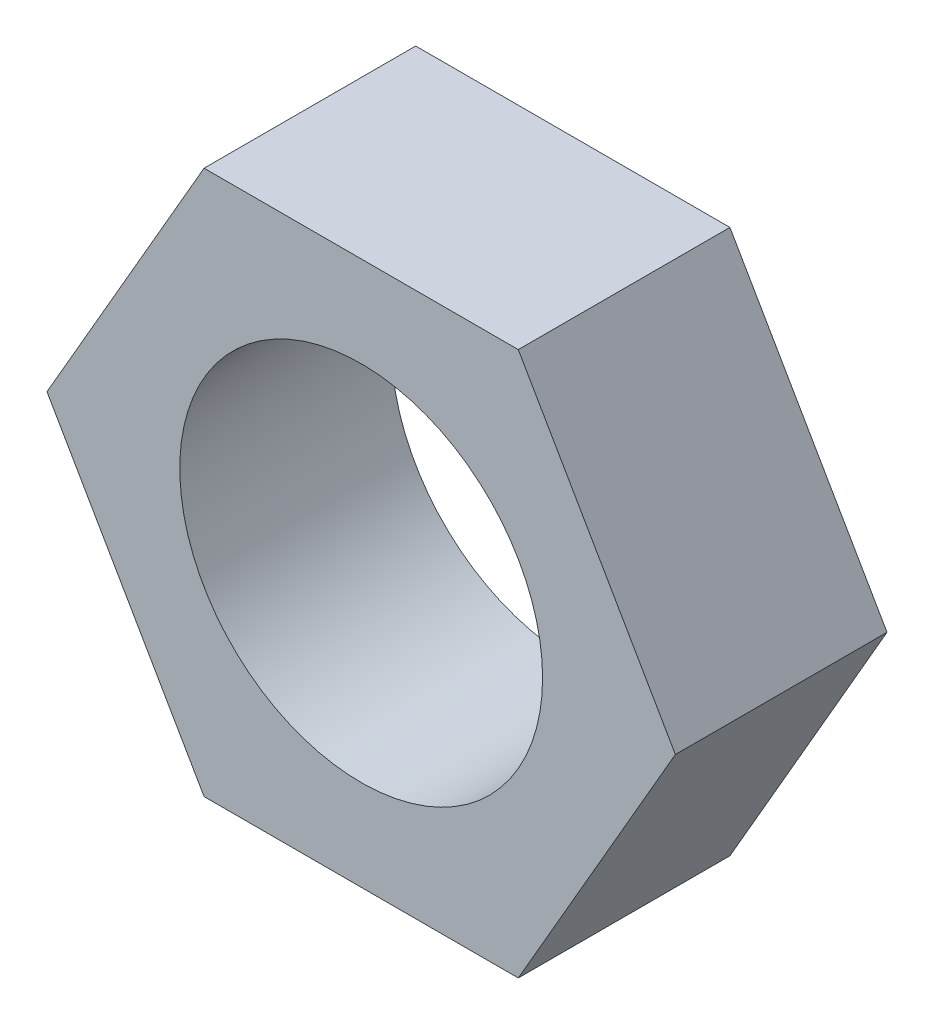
ISO-10303-21;
HEADER;
FILE_DESCRIPTION(('STEP AP214'),'2;1');
FILE_NAME('part.step','',(''),(''),'','','');
FILE_SCHEMA(('AUTOMOTIVE_DESIGN { 1 0 10303 214 1 1 1 1 }'));
ENDSEC;
DATA;
#1=APPLICATION_CONTEXT('core data for automotive mechanical design processes');
#2=APPLICATION_PROTOCOL_DEFINITION('international standard','automotive_design',2000,#1);
#3=PRODUCT_CONTEXT('',#1,'mechanical');
#4=PRODUCT('Part','Part','',(#3));
#5=PRODUCT_RELATED_PRODUCT_CATEGORY('part','',(#4));
#6=PRODUCT_DEFINITION_FORMATION('','',#4);
#7=PRODUCT_DEFINITION_CONTEXT('part definition',#1,'design');
#8=PRODUCT_DEFINITION('design','',#6,#7);
#9=PRODUCT_DEFINITION_SHAPE('','',#8);
#10=(LENGTH_UNIT() NAMED_UNIT(*) SI_UNIT(.MILLI.,.METRE.));
#11=(NAMED_UNIT(*) PLANE_ANGLE_UNIT() SI_UNIT($,.RADIAN.));
#12=(NAMED_UNIT(*) SI_UNIT($,.STERADIAN.) SOLID_ANGLE_UNIT());
#13=UNCERTAINTY_MEASURE_WITH_UNIT(LENGTH_MEASURE(1.E-05),#10,'distance_accuracy_value','');
#14=(GEOMETRIC_REPRESENTATION_CONTEXT(3) GLOBAL_UNCERTAINTY_ASSIGNED_CONTEXT((#13)) GLOBAL_UNIT_ASSIGNED_CONTEXT((#10,
#11,#12)) REPRESENTATION_CONTEXT('',''));
#15=CARTESIAN_POINT('',(0.,0.,0.));
#16=DIRECTION('',(0.,0.,1.));
#17=DIRECTION('',(1.,0.,0.));
#18=AXIS2_PLACEMENT_3D('',#15,#16,#17);
#19=CARTESIAN_POINT('',(4.12444598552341,-7.14374999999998,5.55625));
#20=DIRECTION('',(0.,0.,1.));
#21=DIRECTION('',(1.,0.,0.));
#22=AXIS2_PLACEMENT_3D('',#19,#20,#21);
#23=PLANE('',#22);
#24=DIRECTION('',(1.,0.,0.));
#25=VECTOR('',#24,1.);
#26=CARTESIAN_POINT('',(-4.12444598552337,-7.14374999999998,5.55625));
#27=LINE('',#26,#25);
#28=CARTESIAN_POINT('',(-4.12444598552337,-7.14374999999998,5.55625));
#29=VERTEX_POINT('',#28);
#30=CARTESIAN_POINT('',(4.12444598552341,-7.14374999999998,5.55625));
#31=VERTEX_POINT('',#30);
#32=EDGE_CURVE('E116',#29,#31,#27,.T.);
#33=ORIENTED_EDGE('',*,*,#32,.T.);
#34=DIRECTION('',(0.499999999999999,0.866025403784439,0.));
#35=VECTOR('',#34,1.);
#36=CARTESIAN_POINT('',(4.12444598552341,-7.14374999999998,5.55625));
#37=LINE('',#36,#35);
#38=CARTESIAN_POINT('',(8.24889197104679,0.,5.55625));
#39=VERTEX_POINT('',#38);
#40=EDGE_CURVE('E97',#31,#39,#37,.T.);
#41=ORIENTED_EDGE('',*,*,#40,.T.);
#42=DIRECTION('',(-0.5,0.866025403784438,0.));
#43=VECTOR('',#42,1.);
#44=CARTESIAN_POINT('',(8.24889197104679,0.,5.55625));
#45=LINE('',#44,#43);
#46=CARTESIAN_POINT('',(4.12444598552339,7.14375000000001,5.55625));
#47=VERTEX_POINT('',#46);
#48=EDGE_CURVE('E119',#39,#47,#45,.T.);
#49=ORIENTED_EDGE('',*,*,#48,.T.);
#50=DIRECTION('',(-1.,0.,0.));
#51=VECTOR('',#50,1.);
#52=CARTESIAN_POINT('',(4.12444598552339,7.14375000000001,5.55625));
#53=LINE('',#52,#51);
#54=CARTESIAN_POINT('',(-4.12444598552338,7.14375000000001,5.55625));
#55=VERTEX_POINT('',#54);
#56=EDGE_CURVE('E121',#47,#55,#53,.T.);
#57=ORIENTED_EDGE('',*,*,#56,.T.);
#58=DIRECTION('',(-0.5,-0.866025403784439,0.));
#59=VECTOR('',#58,1.);
#60=CARTESIAN_POINT('',(-4.12444598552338,7.14375000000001,5.55625));
#61=LINE('',#60,#59);
#62=CARTESIAN_POINT('',(-8.24889197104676,0.,5.55625));
#63=VERTEX_POINT('',#62);
#64=EDGE_CURVE('E50',#55,#63,#61,.T.);
#65=ORIENTED_EDGE('',*,*,#64,.T.);
#66=DIRECTION('',(0.5,-0.866025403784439,0.));
#67=VECTOR('',#66,1.);
#68=CARTESIAN_POINT('',(-8.24889197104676,0.,5.55625));
#69=LINE('',#68,#67);
#70=EDGE_CURVE('E45',#63,#29,#69,.T.);
#71=ORIENTED_EDGE('',*,*,#70,.T.);
#72=EDGE_LOOP('',(#33,#41,#49,#57,#65,#71));
#73=FACE_BOUND('',#72,.T.);
#74=CARTESIAN_POINT('',(0.,0.,5.55625));
#75=DIRECTION('',(0.,0.,1.));
#76=DIRECTION('',(1.,0.,0.));
#77=AXIS2_PLACEMENT_3D('',#74,#75,#76);
#78=CIRCLE('',#77,4.7625);
#79=CARTESIAN_POINT('',(4.7625,0.,5.55625));
#80=VERTEX_POINT('',#79);
#81=EDGE_CURVE('E102',#80,#80,#78,.T.);
#82=ORIENTED_EDGE('',*,*,#81,.F.);
#83=EDGE_LOOP('',(#82));
#84=FACE_BOUND('',#83,.T.);
#85=ADVANCED_FACE('F30',(#73,#84),#23,.T.);
#86=CARTESIAN_POINT('',(4.12444598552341,-7.14374999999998,0.));
#87=DIRECTION('',(0.,0.,1.));
#88=DIRECTION('',(1.,0.,0.));
#89=AXIS2_PLACEMENT_3D('',#86,#87,#88);
#90=PLANE('',#89);
#91=DIRECTION('',(1.,0.,0.));
#92=VECTOR('',#91,1.);
#93=CARTESIAN_POINT('',(-4.12444598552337,-7.14374999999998,0.));
#94=LINE('',#93,#92);
#95=CARTESIAN_POINT('',(-4.12444598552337,-7.14374999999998,0.));
#96=VERTEX_POINT('',#95);
#97=CARTESIAN_POINT('',(4.12444598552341,-7.14374999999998,0.));
#98=VERTEX_POINT('',#97);
#99=EDGE_CURVE('E88',#96,#98,#94,.T.);
#100=ORIENTED_EDGE('',*,*,#99,.F.);
#101=DIRECTION('',(0.5,-0.866025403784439,0.));
#102=VECTOR('',#101,1.);
#103=CARTESIAN_POINT('',(-8.24889197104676,0.,0.));
#104=LINE('',#103,#102);
#105=CARTESIAN_POINT('',(-8.24889197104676,0.,0.));
#106=VERTEX_POINT('',#105);
#107=EDGE_CURVE('E114',#106,#96,#104,.T.);
#108=ORIENTED_EDGE('',*,*,#107,.F.);
#109=DIRECTION('',(-0.5,-0.866025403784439,0.));
#110=VECTOR('',#109,1.);
#111=CARTESIAN_POINT('',(-4.12444598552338,7.14375000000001,0.));
#112=LINE('',#111,#110);
#113=CARTESIAN_POINT('',(-4.12444598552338,7.14375000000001,0.));
#114=VERTEX_POINT('',#113);
#115=EDGE_CURVE('E112',#114,#106,#112,.T.);
#116=ORIENTED_EDGE('',*,*,#115,.F.);
#117=DIRECTION('',(-1.,0.,0.));
#118=VECTOR('',#117,1.);
#119=CARTESIAN_POINT('',(4.12444598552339,7.14375000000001,0.));
#120=LINE('',#119,#118);
#121=CARTESIAN_POINT('',(4.12444598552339,7.14375000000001,0.));
#122=VERTEX_POINT('',#121);
#123=EDGE_CURVE('E110',#122,#114,#120,.T.);
#124=ORIENTED_EDGE('',*,*,#123,.F.);
#125=DIRECTION('',(-0.5,0.866025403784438,0.));
#126=VECTOR('',#125,1.);
#127=CARTESIAN_POINT('',(8.24889197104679,0.,0.));
#128=LINE('',#127,#126);
#129=CARTESIAN_POINT('',(8.24889197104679,0.,0.));
#130=VERTEX_POINT('',#129);
#131=EDGE_CURVE('E90',#130,#122,#128,.T.);
#132=ORIENTED_EDGE('',*,*,#131,.F.);
#133=DIRECTION('',(0.499999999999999,0.866025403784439,0.));
#134=VECTOR('',#133,1.);
#135=CARTESIAN_POINT('',(4.12444598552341,-7.14374999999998,0.));
#136=LINE('',#135,#134);
#137=EDGE_CURVE('E83',#98,#130,#136,.T.);
#138=ORIENTED_EDGE('',*,*,#137,.F.);
#139=EDGE_LOOP('',(#100,#108,#116,#124,#132,#138));
#140=FACE_BOUND('',#139,.T.);
#141=CARTESIAN_POINT('',(0.,0.,0.));
#142=DIRECTION('',(0.,0.,1.));
#143=DIRECTION('',(1.,0.,0.));
#144=AXIS2_PLACEMENT_3D('',#141,#142,#143);
#145=CIRCLE('',#144,4.7625);
#146=CARTESIAN_POINT('',(4.7625,0.,0.));
#147=VERTEX_POINT('',#146);
#148=EDGE_CURVE('E105',#147,#147,#145,.T.);
#149=ORIENTED_EDGE('',*,*,#148,.T.);
#150=EDGE_LOOP('',(#149));
#151=FACE_BOUND('',#150,.T.);
#152=ADVANCED_FACE('F84',(#140,#151),#90,.F.);
#153=CARTESIAN_POINT('',(-4.12444598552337,-7.14374999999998,5.55625));
#154=DIRECTION('',(0.,1.,0.));
#155=DIRECTION('',(0.,0.,1.));
#156=AXIS2_PLACEMENT_3D('',#153,#154,#155);
#157=PLANE('',#156);
#158=ORIENTED_EDGE('',*,*,#99,.T.);
#159=DIRECTION('',(0.,0.,-1.));
#160=VECTOR('',#159,1.);
#161=CARTESIAN_POINT('',(4.12444598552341,-7.14374999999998,5.55625));
#162=LINE('',#161,#160);
#163=EDGE_CURVE('E11',#31,#98,#162,.T.);
#164=ORIENTED_EDGE('',*,*,#163,.F.);
#165=ORIENTED_EDGE('',*,*,#32,.F.);
#166=DIRECTION('',(0.,0.,-1.));
#167=VECTOR('',#166,1.);
#168=CARTESIAN_POINT('',(-4.12444598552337,-7.14374999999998,5.55625));
#169=LINE('',#168,#167);
#170=EDGE_CURVE('E101',#29,#96,#169,.T.);
#171=ORIENTED_EDGE('',*,*,#170,.T.);
#172=EDGE_LOOP('',(#158,#164,#165,#171));
#173=FACE_BOUND('',#172,.T.);
#174=ADVANCED_FACE('F32',(#173),#157,.F.);
#175=CARTESIAN_POINT('',(4.12444598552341,-7.14374999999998,5.55625));
#176=DIRECTION('',(-0.866025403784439,0.499999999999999,0.));
#177=DIRECTION('',(-0.499999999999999,-0.866025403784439,0.));
#178=AXIS2_PLACEMENT_3D('',#175,#176,#177);
#179=PLANE('',#178);
#180=ORIENTED_EDGE('',*,*,#137,.T.);
#181=DIRECTION('',(0.,0.,-1.));
#182=VECTOR('',#181,1.);
#183=CARTESIAN_POINT('',(8.24889197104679,0.,5.55625));
#184=LINE('',#183,#182);
#185=EDGE_CURVE('E38',#39,#130,#184,.T.);
#186=ORIENTED_EDGE('',*,*,#185,.F.);
#187=ORIENTED_EDGE('',*,*,#40,.F.);
#188=ORIENTED_EDGE('',*,*,#163,.T.);
#189=EDGE_LOOP('',(#180,#186,#187,#188));
#190=FACE_BOUND('',#189,.T.);
#191=ADVANCED_FACE('F96',(#190),#179,.F.);
#192=CARTESIAN_POINT('',(8.24889197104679,0.,5.55625));
#193=DIRECTION('',(-0.866025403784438,-0.5,0.));
#194=DIRECTION('',(0.5,-0.866025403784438,0.));
#195=AXIS2_PLACEMENT_3D('',#192,#193,#194);
#196=PLANE('',#195);
#197=ORIENTED_EDGE('',*,*,#131,.T.);
#198=DIRECTION('',(0.,0.,-1.));
#199=VECTOR('',#198,1.);
#200=CARTESIAN_POINT('',(4.12444598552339,7.14375000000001,5.55625));
#201=LINE('',#200,#199);
#202=EDGE_CURVE('E132',#47,#122,#201,.T.);
#203=ORIENTED_EDGE('',*,*,#202,.F.);
#204=ORIENTED_EDGE('',*,*,#48,.F.);
#205=ORIENTED_EDGE('',*,*,#185,.T.);
#206=EDGE_LOOP('',(#197,#203,#204,#205));
#207=FACE_BOUND('',#206,.T.);
#208=ADVANCED_FACE('F136',(#207),#196,.F.);
#209=CARTESIAN_POINT('',(4.12444598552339,7.14375000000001,5.55625));
#210=DIRECTION('',(0.,-1.,0.));
#211=DIRECTION('',(0.,0.,-1.));
#212=AXIS2_PLACEMENT_3D('',#209,#210,#211);
#213=PLANE('',#212);
#214=ORIENTED_EDGE('',*,*,#123,.T.);
#215=DIRECTION('',(0.,0.,-1.));
#216=VECTOR('',#215,1.);
#217=CARTESIAN_POINT('',(-4.12444598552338,7.14375000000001,5.55625));
#218=LINE('',#217,#216);
#219=EDGE_CURVE('E129',#55,#114,#218,.T.);
#220=ORIENTED_EDGE('',*,*,#219,.F.);
#221=ORIENTED_EDGE('',*,*,#56,.F.);
#222=ORIENTED_EDGE('',*,*,#202,.T.);
#223=EDGE_LOOP('',(#214,#220,#221,#222));
#224=FACE_BOUND('',#223,.T.);
#225=ADVANCED_FACE('F142',(#224),#213,.F.);
#226=CARTESIAN_POINT('',(-4.12444598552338,7.14375000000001,5.55625));
#227=DIRECTION('',(0.866025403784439,-0.5,0.));
#228=DIRECTION('',(0.5,0.866025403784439,0.));
#229=AXIS2_PLACEMENT_3D('',#226,#227,#228);
#230=PLANE('',#229);
#231=ORIENTED_EDGE('',*,*,#115,.T.);
#232=DIRECTION('',(0.,0.,-1.));
#233=VECTOR('',#232,1.);
#234=CARTESIAN_POINT('',(-8.24889197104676,0.,5.55625));
#235=LINE('',#234,#233);
#236=EDGE_CURVE('E126',#63,#106,#235,.T.);
#237=ORIENTED_EDGE('',*,*,#236,.F.);
#238=ORIENTED_EDGE('',*,*,#64,.F.);
#239=ORIENTED_EDGE('',*,*,#219,.T.);
#240=EDGE_LOOP('',(#231,#237,#238,#239));
#241=FACE_BOUND('',#240,.T.);
#242=ADVANCED_FACE('F145',(#241),#230,.F.);
#243=CARTESIAN_POINT('',(-8.24889197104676,0.,5.55625));
#244=DIRECTION('',(0.866025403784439,0.5,0.));
#245=DIRECTION('',(-0.5,0.866025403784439,0.));
#246=AXIS2_PLACEMENT_3D('',#243,#244,#245);
#247=PLANE('',#246);
#248=ORIENTED_EDGE('',*,*,#107,.T.);
#249=ORIENTED_EDGE('',*,*,#170,.F.);
#250=ORIENTED_EDGE('',*,*,#70,.F.);
#251=ORIENTED_EDGE('',*,*,#236,.T.);
#252=EDGE_LOOP('',(#248,#249,#250,#251));
#253=FACE_BOUND('',#252,.T.);
#254=ADVANCED_FACE('F147',(#253),#247,.F.);
#255=CARTESIAN_POINT('',(0.,0.,5.55625));
#256=DIRECTION('',(0.,0.,-1.));
#257=DIRECTION('',(-1.,0.,0.));
#258=AXIS2_PLACEMENT_3D('',#255,#256,#257);
#259=CYLINDRICAL_SURFACE('',#258,4.7625);
#260=ORIENTED_EDGE('',*,*,#81,.T.);
#261=EDGE_LOOP('',(#260));
#262=FACE_BOUND('',#261,.T.);
#263=ORIENTED_EDGE('',*,*,#148,.F.);
#264=EDGE_LOOP('',(#263));
#265=FACE_BOUND('',#264,.T.);
#266=ADVANCED_FACE('F149',(#262,#265),#259,.F.);
#267=CLOSED_SHELL('',(#85,#152,#174,#191,#208,#225,#242,#254,#266));
#268=MANIFOLD_SOLID_BREP('B2',#267);
#269=ADVANCED_BREP_SHAPE_REPRESENTATION('',(#18,#268),#14);
#270=SHAPE_DEFINITION_REPRESENTATION(#9,#269);
ENDSEC;
END-ISO-10303-21;
